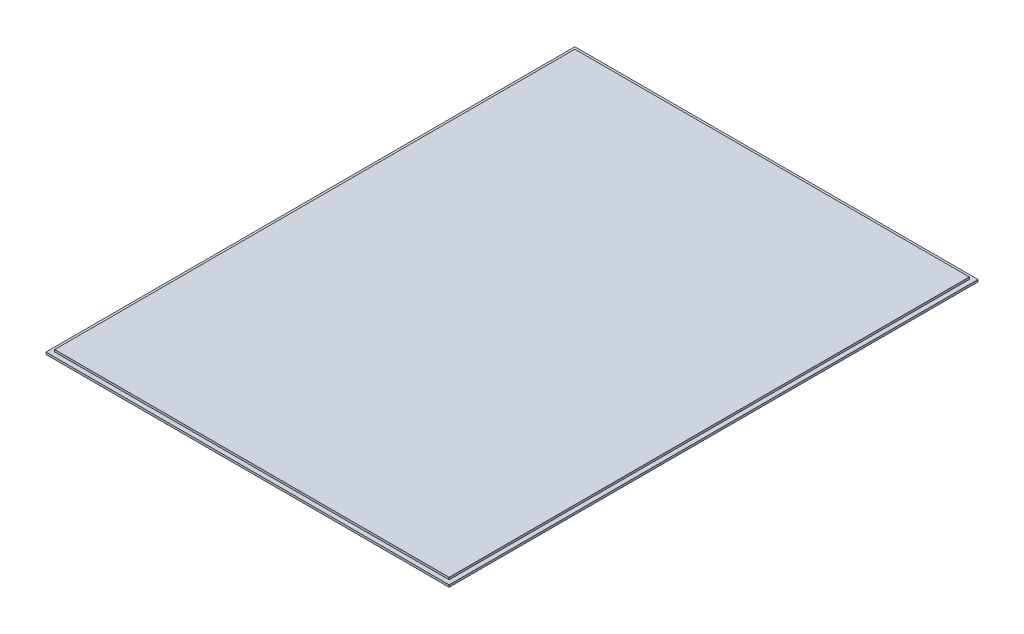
ISO-10303-21;
HEADER;
FILE_DESCRIPTION(('STEP AP214'),'2;1');
FILE_NAME('part.step','',(''),(''),'','','');
FILE_SCHEMA(('AUTOMOTIVE_DESIGN { 1 0 10303 214 1 1 1 1 }'));
ENDSEC;
DATA;
#1=APPLICATION_CONTEXT('core data for automotive mechanical design processes');
#2=APPLICATION_PROTOCOL_DEFINITION('international standard','automotive_design',2000,#1);
#3=PRODUCT_CONTEXT('',#1,'mechanical');
#4=PRODUCT('Part','Part','',(#3));
#5=PRODUCT_RELATED_PRODUCT_CATEGORY('part','',(#4));
#6=PRODUCT_DEFINITION_FORMATION('','',#4);
#7=PRODUCT_DEFINITION_CONTEXT('part definition',#1,'design');
#8=PRODUCT_DEFINITION('design','',#6,#7);
#9=PRODUCT_DEFINITION_SHAPE('','',#8);
#10=(LENGTH_UNIT() NAMED_UNIT(*) SI_UNIT(.MILLI.,.METRE.));
#11=(NAMED_UNIT(*) PLANE_ANGLE_UNIT() SI_UNIT($,.RADIAN.));
#12=(NAMED_UNIT(*) SI_UNIT($,.STERADIAN.) SOLID_ANGLE_UNIT());
#13=UNCERTAINTY_MEASURE_WITH_UNIT(LENGTH_MEASURE(1.E-05),#10,'distance_accuracy_value','');
#14=(GEOMETRIC_REPRESENTATION_CONTEXT(3) GLOBAL_UNCERTAINTY_ASSIGNED_CONTEXT((#13)) GLOBAL_UNIT_ASSIGNED_CONTEXT((#10,
#11,#12)) REPRESENTATION_CONTEXT('',''));
#15=CARTESIAN_POINT('',(0.,0.,0.));
#16=DIRECTION('',(0.,0.,1.));
#17=DIRECTION('',(1.,0.,0.));
#18=AXIS2_PLACEMENT_3D('',#15,#16,#17);
#19=CARTESIAN_POINT('',(295.275,6.35,387.35));
#20=DIRECTION('',(-1.,0.,0.));
#21=DIRECTION('',(0.,0.,1.));
#22=AXIS2_PLACEMENT_3D('',#19,#20,#21);
#23=PLANE('',#22);
#24=DIRECTION('',(0.,0.,-1.));
#25=VECTOR('',#24,1.);
#26=CARTESIAN_POINT('',(295.275,3.175,387.35));
#27=LINE('',#26,#25);
#28=CARTESIAN_POINT('',(295.275,3.175,387.35));
#29=VERTEX_POINT('',#28);
#30=CARTESIAN_POINT('',(295.275,3.175,-387.35));
#31=VERTEX_POINT('',#30);
#32=EDGE_CURVE('E146',#29,#31,#27,.T.);
#33=ORIENTED_EDGE('',*,*,#32,.F.);
#34=DIRECTION('',(0.,-1.,0.));
#35=VECTOR('',#34,1.);
#36=CARTESIAN_POINT('',(295.275,6.35,387.35));
#37=LINE('',#36,#35);
#38=CARTESIAN_POINT('',(295.275,0.,387.35));
#39=VERTEX_POINT('',#38);
#40=EDGE_CURVE('E160',#29,#39,#37,.T.);
#41=ORIENTED_EDGE('',*,*,#40,.T.);
#42=DIRECTION('',(0.,0.,-1.));
#43=VECTOR('',#42,1.);
#44=CARTESIAN_POINT('',(295.275,0.,387.35));
#45=LINE('',#44,#43);
#46=CARTESIAN_POINT('',(295.275,0.,-387.35));
#47=VERTEX_POINT('',#46);
#48=EDGE_CURVE('E148',#39,#47,#45,.T.);
#49=ORIENTED_EDGE('',*,*,#48,.T.);
#50=DIRECTION('',(0.,-1.,0.));
#51=VECTOR('',#50,1.);
#52=CARTESIAN_POINT('',(295.275,6.35,-387.35));
#53=LINE('',#52,#51);
#54=EDGE_CURVE('E47',#31,#47,#53,.T.);
#55=ORIENTED_EDGE('',*,*,#54,.F.);
#56=EDGE_LOOP('',(#33,#41,#49,#55));
#57=FACE_BOUND('',#56,.T.);
#58=ADVANCED_FACE('F40',(#57),#23,.F.);
#59=CARTESIAN_POINT('',(-295.275,6.35,-387.35));
#60=DIRECTION('',(0.,0.,1.));
#61=DIRECTION('',(1.,0.,0.));
#62=AXIS2_PLACEMENT_3D('',#59,#60,#61);
#63=PLANE('',#62);
#64=DIRECTION('',(-1.,0.,0.));
#65=VECTOR('',#64,1.);
#66=CARTESIAN_POINT('',(-295.275,3.175,-387.35));
#67=LINE('',#66,#65);
#68=CARTESIAN_POINT('',(-295.275,3.175,-387.35));
#69=VERTEX_POINT('',#68);
#70=EDGE_CURVE('E144',#31,#69,#67,.T.);
#71=ORIENTED_EDGE('',*,*,#70,.F.);
#72=ORIENTED_EDGE('',*,*,#54,.T.);
#73=DIRECTION('',(-1.,0.,0.));
#74=VECTOR('',#73,1.);
#75=CARTESIAN_POINT('',(-295.275,0.,-387.35));
#76=LINE('',#75,#74);
#77=CARTESIAN_POINT('',(-295.275,0.,-387.35));
#78=VERTEX_POINT('',#77);
#79=EDGE_CURVE('E151',#47,#78,#76,.T.);
#80=ORIENTED_EDGE('',*,*,#79,.T.);
#81=DIRECTION('',(0.,-1.,0.));
#82=VECTOR('',#81,1.);
#83=CARTESIAN_POINT('',(-295.275,6.35,-387.35));
#84=LINE('',#83,#82);
#85=EDGE_CURVE('E164',#69,#78,#84,.T.);
#86=ORIENTED_EDGE('',*,*,#85,.F.);
#87=EDGE_LOOP('',(#71,#72,#80,#86));
#88=FACE_BOUND('',#87,.T.);
#89=ADVANCED_FACE('F169',(#88),#63,.F.);
#90=CARTESIAN_POINT('',(-295.275,6.35,387.35));
#91=DIRECTION('',(1.,0.,0.));
#92=DIRECTION('',(0.,0.,-1.));
#93=AXIS2_PLACEMENT_3D('',#90,#91,#92);
#94=PLANE('',#93);
#95=DIRECTION('',(0.,0.,1.));
#96=VECTOR('',#95,1.);
#97=CARTESIAN_POINT('',(-295.275,3.175,387.35));
#98=LINE('',#97,#96);
#99=CARTESIAN_POINT('',(-295.275,3.175,387.35));
#100=VERTEX_POINT('',#99);
#101=EDGE_CURVE('E53',#69,#100,#98,.T.);
#102=ORIENTED_EDGE('',*,*,#101,.F.);
#103=ORIENTED_EDGE('',*,*,#85,.T.);
#104=DIRECTION('',(0.,0.,1.));
#105=VECTOR('',#104,1.);
#106=CARTESIAN_POINT('',(-295.275,0.,387.35));
#107=LINE('',#106,#105);
#108=CARTESIAN_POINT('',(-295.275,0.,387.35));
#109=VERTEX_POINT('',#108);
#110=EDGE_CURVE('E154',#78,#109,#107,.T.);
#111=ORIENTED_EDGE('',*,*,#110,.T.);
#112=DIRECTION('',(0.,-1.,0.));
#113=VECTOR('',#112,1.);
#114=CARTESIAN_POINT('',(-295.275,6.35,387.35));
#115=LINE('',#114,#113);
#116=EDGE_CURVE('E162',#100,#109,#115,.T.);
#117=ORIENTED_EDGE('',*,*,#116,.F.);
#118=EDGE_LOOP('',(#102,#103,#111,#117));
#119=FACE_BOUND('',#118,.T.);
#120=ADVANCED_FACE('F183',(#119),#94,.F.);
#121=CARTESIAN_POINT('',(-295.275,6.35,387.35));
#122=DIRECTION('',(0.,0.,-1.));
#123=DIRECTION('',(-1.,0.,0.));
#124=AXIS2_PLACEMENT_3D('',#121,#122,#123);
#125=PLANE('',#124);
#126=DIRECTION('',(1.,0.,0.));
#127=VECTOR('',#126,1.);
#128=CARTESIAN_POINT('',(-295.275,3.175,387.35));
#129=LINE('',#128,#127);
#130=EDGE_CURVE('E13',#100,#29,#129,.T.);
#131=ORIENTED_EDGE('',*,*,#130,.F.);
#132=ORIENTED_EDGE('',*,*,#116,.T.);
#133=DIRECTION('',(1.,0.,0.));
#134=VECTOR('',#133,1.);
#135=CARTESIAN_POINT('',(-295.275,0.,387.35));
#136=LINE('',#135,#134);
#137=EDGE_CURVE('E157',#109,#39,#136,.T.);
#138=ORIENTED_EDGE('',*,*,#137,.T.);
#139=ORIENTED_EDGE('',*,*,#40,.F.);
#140=EDGE_LOOP('',(#131,#132,#138,#139));
#141=FACE_BOUND('',#140,.T.);
#142=ADVANCED_FACE('F180',(#141),#125,.F.);
#143=CARTESIAN_POINT('',(0.,0.,0.));
#144=DIRECTION('',(0.,-1.,0.));
#145=DIRECTION('',(0.,0.,-1.));
#146=AXIS2_PLACEMENT_3D('',#143,#144,#145);
#147=PLANE('',#146);
#148=ORIENTED_EDGE('',*,*,#48,.F.);
#149=ORIENTED_EDGE('',*,*,#137,.F.);
#150=ORIENTED_EDGE('',*,*,#110,.F.);
#151=ORIENTED_EDGE('',*,*,#79,.F.);
#152=EDGE_LOOP('',(#148,#149,#150,#151));
#153=FACE_BOUND('',#152,.T.);
#154=ADVANCED_FACE('F176',(#153),#147,.T.);
#155=CARTESIAN_POINT('',(-1.11022302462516E-13,3.175,0.));
#156=DIRECTION('',(0.,1.,0.));
#157=DIRECTION('',(0.,0.,1.));
#158=AXIS2_PLACEMENT_3D('',#155,#156,#157);
#159=PLANE('',#158);
#160=DIRECTION('',(1.,0.,0.));
#161=VECTOR('',#160,1.);
#162=CARTESIAN_POINT('',(-288.925,3.175,381.));
#163=LINE('',#162,#161);
#164=CARTESIAN_POINT('',(-288.925,3.175,381.));
#165=VERTEX_POINT('',#164);
#166=CARTESIAN_POINT('',(288.925,3.175,381.));
#167=VERTEX_POINT('',#166);
#168=EDGE_CURVE('E115',#165,#167,#163,.T.);
#169=ORIENTED_EDGE('',*,*,#168,.F.);
#170=DIRECTION('',(0.,0.,1.));
#171=VECTOR('',#170,1.);
#172=CARTESIAN_POINT('',(-288.925,3.175,381.));
#173=LINE('',#172,#171);
#174=CARTESIAN_POINT('',(-288.925,3.175,-381.));
#175=VERTEX_POINT('',#174);
#176=EDGE_CURVE('E124',#175,#165,#173,.T.);
#177=ORIENTED_EDGE('',*,*,#176,.F.);
#178=DIRECTION('',(-1.,0.,0.));
#179=VECTOR('',#178,1.);
#180=CARTESIAN_POINT('',(-288.925,3.175,-381.));
#181=LINE('',#180,#179);
#182=CARTESIAN_POINT('',(288.925,3.175,-381.));
#183=VERTEX_POINT('',#182);
#184=EDGE_CURVE('E107',#183,#175,#181,.T.);
#185=ORIENTED_EDGE('',*,*,#184,.F.);
#186=DIRECTION('',(0.,0.,-1.));
#187=VECTOR('',#186,1.);
#188=CARTESIAN_POINT('',(288.925,3.175,381.));
#189=LINE('',#188,#187);
#190=EDGE_CURVE('E121',#167,#183,#189,.T.);
#191=ORIENTED_EDGE('',*,*,#190,.F.);
#192=EDGE_LOOP('',(#169,#177,#185,#191));
#193=FACE_BOUND('',#192,.T.);
#194=ORIENTED_EDGE('',*,*,#32,.T.);
#195=ORIENTED_EDGE('',*,*,#70,.T.);
#196=ORIENTED_EDGE('',*,*,#101,.T.);
#197=ORIENTED_EDGE('',*,*,#130,.T.);
#198=EDGE_LOOP('',(#194,#195,#196,#197));
#199=FACE_BOUND('',#198,.T.);
#200=ADVANCED_FACE('F120',(#193,#199),#159,.T.);
#201=CARTESIAN_POINT('',(288.925,3.175,381.));
#202=DIRECTION('',(1.,0.,0.));
#203=DIRECTION('',(0.,0.,-1.));
#204=AXIS2_PLACEMENT_3D('',#201,#202,#203);
#205=PLANE('',#204);
#206=DIRECTION('',(0.,0.,-1.));
#207=VECTOR('',#206,1.);
#208=CARTESIAN_POINT('',(288.925,6.35,381.));
#209=LINE('',#208,#207);
#210=CARTESIAN_POINT('',(288.925,6.35,381.));
#211=VERTEX_POINT('',#210);
#212=CARTESIAN_POINT('',(288.925,6.35,-381.));
#213=VERTEX_POINT('',#212);
#214=EDGE_CURVE('E135',#211,#213,#209,.T.);
#215=ORIENTED_EDGE('',*,*,#214,.F.);
#216=DIRECTION('',(0.,1.,0.));
#217=VECTOR('',#216,1.);
#218=CARTESIAN_POINT('',(288.925,3.175,381.));
#219=LINE('',#218,#217);
#220=EDGE_CURVE('E127',#167,#211,#219,.T.);
#221=ORIENTED_EDGE('',*,*,#220,.F.);
#222=ORIENTED_EDGE('',*,*,#190,.T.);
#223=DIRECTION('',(0.,1.,0.));
#224=VECTOR('',#223,1.);
#225=CARTESIAN_POINT('',(288.925,3.175,-381.));
#226=LINE('',#225,#224);
#227=EDGE_CURVE('E104',#183,#213,#226,.T.);
#228=ORIENTED_EDGE('',*,*,#227,.T.);
#229=EDGE_LOOP('',(#215,#221,#222,#228));
#230=FACE_BOUND('',#229,.T.);
#231=ADVANCED_FACE('F126',(#230),#205,.T.);
#232=CARTESIAN_POINT('',(-288.925,3.175,381.));
#233=DIRECTION('',(0.,0.,1.));
#234=DIRECTION('',(1.,0.,0.));
#235=AXIS2_PLACEMENT_3D('',#232,#233,#234);
#236=PLANE('',#235);
#237=DIRECTION('',(1.,0.,0.));
#238=VECTOR('',#237,1.);
#239=CARTESIAN_POINT('',(-288.925,6.35,381.));
#240=LINE('',#239,#238);
#241=CARTESIAN_POINT('',(-288.925,6.35,381.));
#242=VERTEX_POINT('',#241);
#243=EDGE_CURVE('E128',#242,#211,#240,.T.);
#244=ORIENTED_EDGE('',*,*,#243,.F.);
#245=DIRECTION('',(0.,1.,0.));
#246=VECTOR('',#245,1.);
#247=CARTESIAN_POINT('',(-288.925,3.175,381.));
#248=LINE('',#247,#246);
#249=EDGE_CURVE('E140',#165,#242,#248,.T.);
#250=ORIENTED_EDGE('',*,*,#249,.F.);
#251=ORIENTED_EDGE('',*,*,#168,.T.);
#252=ORIENTED_EDGE('',*,*,#220,.T.);
#253=EDGE_LOOP('',(#244,#250,#251,#252));
#254=FACE_BOUND('',#253,.T.);
#255=ADVANCED_FACE('F230',(#254),#236,.T.);
#256=CARTESIAN_POINT('',(-288.925,3.175,381.));
#257=DIRECTION('',(-1.,0.,0.));
#258=DIRECTION('',(0.,0.,1.));
#259=AXIS2_PLACEMENT_3D('',#256,#257,#258);
#260=PLANE('',#259);
#261=DIRECTION('',(0.,0.,1.));
#262=VECTOR('',#261,1.);
#263=CARTESIAN_POINT('',(-288.925,6.35,381.));
#264=LINE('',#263,#262);
#265=CARTESIAN_POINT('',(-288.925,6.35,-381.));
#266=VERTEX_POINT('',#265);
#267=EDGE_CURVE('E61',#266,#242,#264,.T.);
#268=ORIENTED_EDGE('',*,*,#267,.F.);
#269=DIRECTION('',(0.,1.,0.));
#270=VECTOR('',#269,1.);
#271=CARTESIAN_POINT('',(-288.925,3.175,-381.));
#272=LINE('',#271,#270);
#273=EDGE_CURVE('E114',#175,#266,#272,.T.);
#274=ORIENTED_EDGE('',*,*,#273,.F.);
#275=ORIENTED_EDGE('',*,*,#176,.T.);
#276=ORIENTED_EDGE('',*,*,#249,.T.);
#277=EDGE_LOOP('',(#268,#274,#275,#276));
#278=FACE_BOUND('',#277,.T.);
#279=ADVANCED_FACE('F240',(#278),#260,.T.);
#280=CARTESIAN_POINT('',(-288.925,3.175,-381.));
#281=DIRECTION('',(0.,0.,-1.));
#282=DIRECTION('',(-1.,0.,0.));
#283=AXIS2_PLACEMENT_3D('',#280,#281,#282);
#284=PLANE('',#283);
#285=DIRECTION('',(-1.,0.,0.));
#286=VECTOR('',#285,1.);
#287=CARTESIAN_POINT('',(-288.925,6.35,-381.));
#288=LINE('',#287,#286);
#289=EDGE_CURVE('E109',#213,#266,#288,.T.);
#290=ORIENTED_EDGE('',*,*,#289,.F.);
#291=ORIENTED_EDGE('',*,*,#227,.F.);
#292=ORIENTED_EDGE('',*,*,#184,.T.);
#293=ORIENTED_EDGE('',*,*,#273,.T.);
#294=EDGE_LOOP('',(#290,#291,#292,#293));
#295=FACE_BOUND('',#294,.T.);
#296=ADVANCED_FACE('F106',(#295),#284,.T.);
#297=CARTESIAN_POINT('',(0.,6.35,0.));
#298=DIRECTION('',(0.,-1.,0.));
#299=DIRECTION('',(0.,0.,-1.));
#300=AXIS2_PLACEMENT_3D('',#297,#298,#299);
#301=PLANE('',#300);
#302=ORIENTED_EDGE('',*,*,#214,.T.);
#303=ORIENTED_EDGE('',*,*,#289,.T.);
#304=ORIENTED_EDGE('',*,*,#267,.T.);
#305=ORIENTED_EDGE('',*,*,#243,.T.);
#306=EDGE_LOOP('',(#302,#303,#304,#305));
#307=FACE_BOUND('',#306,.T.);
#308=ADVANCED_FACE('F260',(#307),#301,.F.);
#309=CLOSED_SHELL('',(#58,#89,#120,#142,#154,#200,#231,#255,#279,#296,#308));
#310=MANIFOLD_SOLID_BREP('B2',#309);
#311=ADVANCED_BREP_SHAPE_REPRESENTATION('',(#18,#310),#14);
#312=SHAPE_DEFINITION_REPRESENTATION(#9,#311);
ENDSEC;
END-ISO-10303-21;
